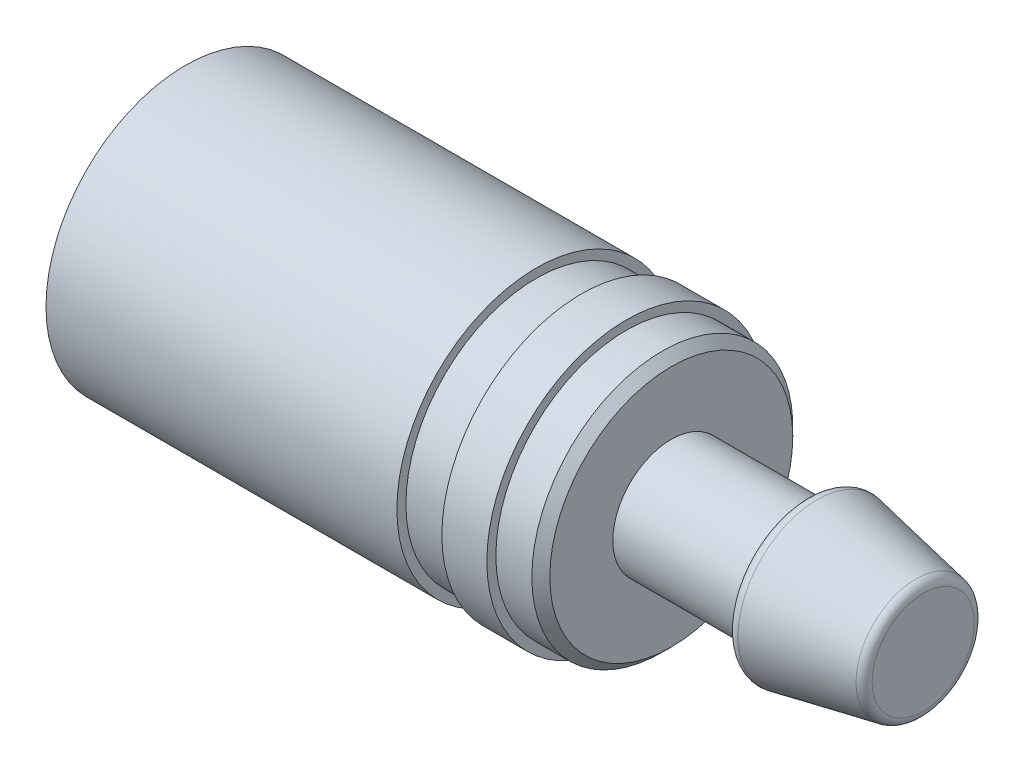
from build123d import *

# Parameters (mm, degrees)
REDONDEO1_R   = 1
CHAFL_N1_SIZE = 1


with BuildPart() as part:
    # Croquis1 → Revoluci_n1 (revolve)
    with BuildSketch(Plane.XY, mode=Mode.PRIVATE) as revoluci_n1_sk:
        Polygon((0, 0), (0, 15.5), (39, 15.5), (39, 14.5), (44, 14.5), (44, 15.5), (49, 15.5), (49, 14.5), (54, 14.5), (54, 6.5), (69, 6.5), (69, 9), (82, 6.5), (82, 0), align=None)
    revolve(revoluci_n1_sk.sketch.rotate(Axis((0, 0, 0), (1, 0, 0)), 90), axis=Axis((0, 0, 0), (1, 0, 0)))

    # Redondeo1
    redondeo1_edges = [part.edges().sort_by_distance(p)[0] for p in [
        (69, 0, -9),
        (82, 0, -6.5),
    ]]
    fillet(redondeo1_edges, radius=REDONDEO1_R)

    # Chafl_n1
    chafl_n1_edges = [part.edges().sort_by_distance(p)[0] for p in [
        (54, 0, -14.5),
    ]]
    chamfer(chafl_n1_edges, length=CHAFL_N1_SIZE)


solid = part.part
